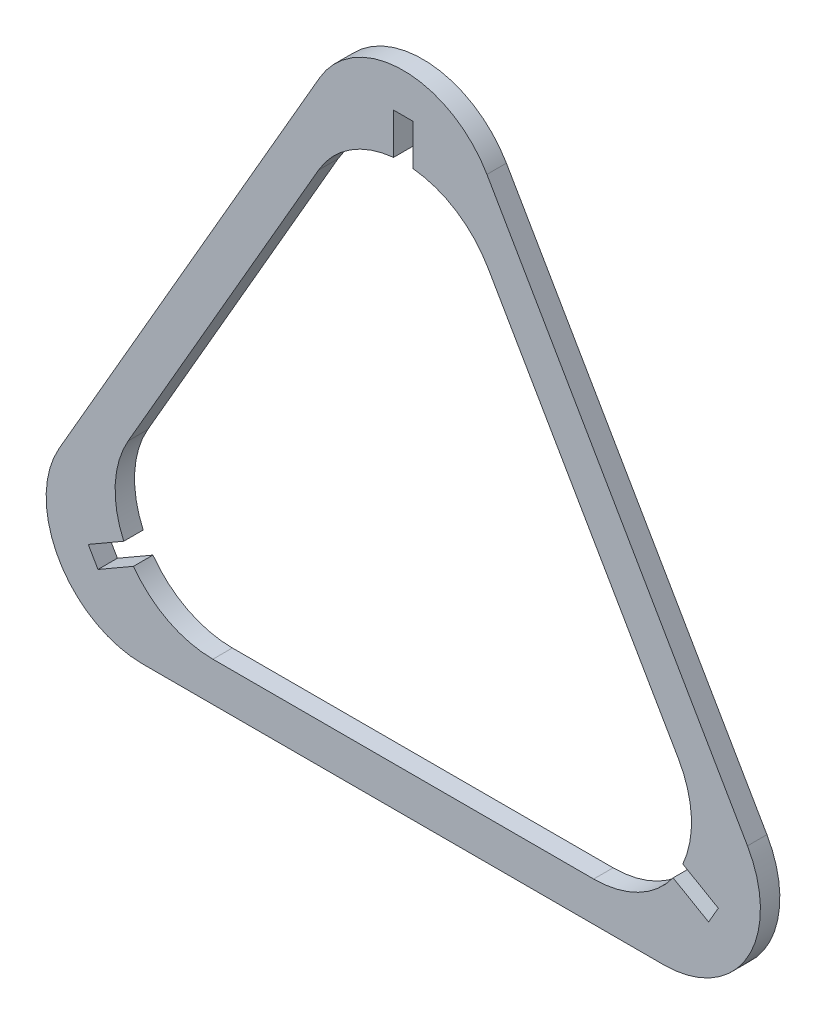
ISO-10303-21;
HEADER;
FILE_DESCRIPTION(('STEP AP214'),'2;1');
FILE_NAME('part.step','',(''),(''),'','','');
FILE_SCHEMA(('AUTOMOTIVE_DESIGN { 1 0 10303 214 1 1 1 1 }'));
ENDSEC;
DATA;
#1=APPLICATION_CONTEXT('core data for automotive mechanical design processes');
#2=APPLICATION_PROTOCOL_DEFINITION('international standard','automotive_design',2000,#1);
#3=PRODUCT_CONTEXT('',#1,'mechanical');
#4=PRODUCT('Part','Part','',(#3));
#5=PRODUCT_RELATED_PRODUCT_CATEGORY('part','',(#4));
#6=PRODUCT_DEFINITION_FORMATION('','',#4);
#7=PRODUCT_DEFINITION_CONTEXT('part definition',#1,'design');
#8=PRODUCT_DEFINITION('design','',#6,#7);
#9=PRODUCT_DEFINITION_SHAPE('','',#8);
#10=(LENGTH_UNIT() NAMED_UNIT(*) SI_UNIT(.MILLI.,.METRE.));
#11=(NAMED_UNIT(*) PLANE_ANGLE_UNIT() SI_UNIT($,.RADIAN.));
#12=(NAMED_UNIT(*) SI_UNIT($,.STERADIAN.) SOLID_ANGLE_UNIT());
#13=UNCERTAINTY_MEASURE_WITH_UNIT(LENGTH_MEASURE(1.E-05),#10,'distance_accuracy_value','');
#14=(GEOMETRIC_REPRESENTATION_CONTEXT(3) GLOBAL_UNCERTAINTY_ASSIGNED_CONTEXT((#13)) GLOBAL_UNIT_ASSIGNED_CONTEXT((#10,
#11,#12)) REPRESENTATION_CONTEXT('',''));
#15=CARTESIAN_POINT('',(0.,0.,0.));
#16=DIRECTION('',(0.,0.,1.));
#17=DIRECTION('',(1.,0.,0.));
#18=AXIS2_PLACEMENT_3D('',#15,#16,#17);
#19=CARTESIAN_POINT('',(39.1709623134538,-22.6153656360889,0.));
#20=DIRECTION('',(0.,0.,1.));
#21=DIRECTION('',(1.,0.,0.));
#22=AXIS2_PLACEMENT_3D('',#19,#20,#21);
#23=CYLINDRICAL_SURFACE('',#22,20.125);
#24=DIRECTION('',(0.,0.,1.));
#25=VECTOR('',#24,1.);
#26=CARTESIAN_POINT('',(57.513445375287,-30.8960020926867,0.));
#27=LINE('',#26,#25);
#28=CARTESIAN_POINT('',(57.513445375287,-30.8960020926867,0.));
#29=VERTEX_POINT('',#28);
#30=CARTESIAN_POINT('',(57.513445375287,-30.8960020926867,4.));
#31=VERTEX_POINT('',#30);
#32=EDGE_CURVE('E227',#29,#31,#27,.T.);
#33=ORIENTED_EDGE('',*,*,#32,.T.);
#34=CARTESIAN_POINT('',(39.1709623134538,-22.6153656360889,4.));
#35=DIRECTION('',(0.,0.,1.));
#36=DIRECTION('',(1.,0.,0.));
#37=AXIS2_PLACEMENT_3D('',#34,#35,#36);
#38=CIRCLE('',#37,20.125);
#39=CARTESIAN_POINT('',(56.5997235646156,-12.5528656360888,4.));
#40=VERTEX_POINT('',#39);
#41=EDGE_CURVE('E259',#40,#31,#38,.F.);
#42=ORIENTED_EDGE('',*,*,#41,.F.);
#43=DIRECTION('',(0.,0.,1.));
#44=VECTOR('',#43,1.);
#45=CARTESIAN_POINT('',(56.5997235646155,-12.5528656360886,0.));
#46=LINE('',#45,#44);
#47=CARTESIAN_POINT('',(56.5997235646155,-12.5528656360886,0.));
#48=VERTEX_POINT('',#47);
#49=EDGE_CURVE('E278',#48,#40,#46,.T.);
#50=ORIENTED_EDGE('',*,*,#49,.F.);
#51=CARTESIAN_POINT('',(39.1709623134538,-22.6153656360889,0.));
#52=DIRECTION('',(0.,0.,-1.));
#53=DIRECTION('',(-1.,0.,0.));
#54=AXIS2_PLACEMENT_3D('',#51,#52,#53);
#55=CIRCLE('',#54,20.125);
#56=EDGE_CURVE('E342',#48,#29,#55,.T.);
#57=ORIENTED_EDGE('',*,*,#56,.T.);
#58=EDGE_LOOP('',(#33,#42,#50,#57));
#59=FACE_BOUND('',#58,.T.);
#60=ADVANCED_FACE('F37',(#59),#23,.F.);
#61=CARTESIAN_POINT('',(-39.1709623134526,-22.6153656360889,0.));
#62=DIRECTION('',(0.,0.,1.));
#63=DIRECTION('',(1.,0.,0.));
#64=AXIS2_PLACEMENT_3D('',#61,#62,#63);
#65=CYLINDRICAL_SURFACE('',#64,20.125);
#66=CARTESIAN_POINT('',(-39.1709623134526,-22.6153656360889,0.));
#67=DIRECTION('',(0.,0.,-1.));
#68=DIRECTION('',(-1.,0.,0.));
#69=AXIS2_PLACEMENT_3D('',#66,#67,#68);
#70=CIRCLE('',#69,20.125);
#71=CARTESIAN_POINT('',(-55.5134453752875,-34.3601037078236,0.));
#72=VERTEX_POINT('',#71);
#73=CARTESIAN_POINT('',(-39.1709623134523,-42.7403656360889,0.));
#74=VERTEX_POINT('',#73);
#75=EDGE_CURVE('E357',#72,#74,#70,.F.);
#76=ORIENTED_EDGE('',*,*,#75,.F.);
#77=DIRECTION('',(0.,0.,1.));
#78=VECTOR('',#77,1.);
#79=CARTESIAN_POINT('',(-55.5134453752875,-34.3601037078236,0.));
#80=LINE('',#79,#78);
#81=CARTESIAN_POINT('',(-55.5134453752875,-34.3601037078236,4.));
#82=VERTEX_POINT('',#81);
#83=EDGE_CURVE('E253',#72,#82,#80,.T.);
#84=ORIENTED_EDGE('',*,*,#83,.T.);
#85=CARTESIAN_POINT('',(-39.1709623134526,-22.6153656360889,4.));
#86=DIRECTION('',(0.,0.,1.));
#87=DIRECTION('',(1.,0.,0.));
#88=AXIS2_PLACEMENT_3D('',#85,#86,#87);
#89=CIRCLE('',#88,20.125);
#90=CARTESIAN_POINT('',(-39.1709623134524,-42.7403656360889,4.));
#91=VERTEX_POINT('',#90);
#92=EDGE_CURVE('E272',#82,#91,#89,.T.);
#93=ORIENTED_EDGE('',*,*,#92,.T.);
#94=DIRECTION('',(0.,0.,1.));
#95=VECTOR('',#94,1.);
#96=CARTESIAN_POINT('',(-39.1709623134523,-42.7403656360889,0.));
#97=LINE('',#96,#95);
#98=EDGE_CURVE('E266',#74,#91,#97,.T.);
#99=ORIENTED_EDGE('',*,*,#98,.F.);
#100=EDGE_LOOP('',(#76,#84,#93,#99));
#101=FACE_BOUND('',#100,.T.);
#102=ADVANCED_FACE('F432',(#101),#65,.F.);
#103=CARTESIAN_POINT('',(6.20597323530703E-13,45.2307312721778,0.));
#104=DIRECTION('',(0.,0.,1.));
#105=DIRECTION('',(1.,0.,0.));
#106=AXIS2_PLACEMENT_3D('',#103,#104,#105);
#107=CYLINDRICAL_SURFACE('',#106,20.125);
#108=CARTESIAN_POINT('',(6.20597323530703E-13,45.2307312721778,4.));
#109=DIRECTION('',(0.,0.,1.));
#110=DIRECTION('',(1.,0.,0.));
#111=AXIS2_PLACEMENT_3D('',#108,#109,#110);
#112=CIRCLE('',#111,20.125);
#113=CARTESIAN_POINT('',(17.4287612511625,55.2932312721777,4.));
#114=VERTEX_POINT('',#113);
#115=CARTESIAN_POINT('',(2.,65.2561058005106,4.));
#116=VERTEX_POINT('',#115);
#117=EDGE_CURVE('E233',#114,#116,#112,.T.);
#118=ORIENTED_EDGE('',*,*,#117,.T.);
#119=DIRECTION('',(0.,0.,1.));
#120=VECTOR('',#119,1.);
#121=CARTESIAN_POINT('',(2.,65.2561058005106,0.));
#122=LINE('',#121,#120);
#123=CARTESIAN_POINT('',(2.,65.2561058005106,0.));
#124=VERTEX_POINT('',#123);
#125=EDGE_CURVE('E348',#116,#124,#122,.F.);
#126=ORIENTED_EDGE('',*,*,#125,.T.);
#127=CARTESIAN_POINT('',(6.20597323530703E-13,45.2307312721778,0.));
#128=DIRECTION('',(0.,0.,-1.));
#129=DIRECTION('',(-1.,0.,0.));
#130=AXIS2_PLACEMENT_3D('',#127,#128,#129);
#131=CIRCLE('',#130,20.125);
#132=CARTESIAN_POINT('',(17.4287612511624,55.2932312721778,0.));
#133=VERTEX_POINT('',#132);
#134=EDGE_CURVE('E41',#133,#124,#131,.F.);
#135=ORIENTED_EDGE('',*,*,#134,.F.);
#136=DIRECTION('',(0.,0.,1.));
#137=VECTOR('',#136,1.);
#138=CARTESIAN_POINT('',(17.4287612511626,55.2932312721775,0.));
#139=LINE('',#138,#137);
#140=EDGE_CURVE('E335',#133,#114,#139,.T.);
#141=ORIENTED_EDGE('',*,*,#140,.T.);
#142=EDGE_LOOP('',(#118,#126,#135,#141));
#143=FACE_BOUND('',#142,.T.);
#144=ADVANCED_FACE('F406',(#143),#107,.F.);
#145=CARTESIAN_POINT('',(0.,0.,0.));
#146=DIRECTION('',(0.,0.,1.));
#147=DIRECTION('',(1.,0.,0.));
#148=AXIS2_PLACEMENT_3D('',#145,#146,#147);
#149=PLANE('',#148);
#150=DIRECTION('',(-0.5,0.866025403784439,0.));
#151=VECTOR('',#150,1.);
#152=CARTESIAN_POINT('',(70.8169739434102,-21.0111989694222,0.));
#153=LINE('',#152,#151);
#154=CARTESIAN_POINT('',(70.8169739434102,-21.0111989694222,0.));
#155=VERTEX_POINT('',#154);
#156=CARTESIAN_POINT('',(17.2122549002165,71.8348979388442,0.));
#157=VERTEX_POINT('',#156);
#158=EDGE_CURVE('E316',#155,#157,#153,.T.);
#159=ORIENTED_EDGE('',*,*,#158,.F.);
#160=CARTESIAN_POINT('',(53.6047190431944,-30.9486989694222,0.));
#161=DIRECTION('',(0.,0.,-1.));
#162=DIRECTION('',(-1.,0.,0.));
#163=AXIS2_PLACEMENT_3D('',#160,#161,#162);
#164=CIRCLE('',#163,19.875);
#165=CARTESIAN_POINT('',(53.6047190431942,-50.8236989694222,0.));
#166=VERTEX_POINT('',#165);
#167=EDGE_CURVE('E331',#155,#166,#164,.T.);
#168=ORIENTED_EDGE('',*,*,#167,.T.);
#169=DIRECTION('',(1.,0.,0.));
#170=VECTOR('',#169,1.);
#171=CARTESIAN_POINT('',(53.6047190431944,-50.8236989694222,0.));
#172=LINE('',#171,#170);
#173=CARTESIAN_POINT('',(-53.6047190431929,-50.8236989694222,0.));
#174=VERTEX_POINT('',#173);
#175=EDGE_CURVE('E301',#174,#166,#172,.T.);
#176=ORIENTED_EDGE('',*,*,#175,.F.);
#177=CARTESIAN_POINT('',(-53.6047190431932,-30.9486989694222,0.));
#178=DIRECTION('',(0.,0.,-1.));
#179=DIRECTION('',(-1.,0.,0.));
#180=AXIS2_PLACEMENT_3D('',#177,#178,#179);
#181=CIRCLE('',#180,19.875);
#182=CARTESIAN_POINT('',(-70.8169739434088,-21.0111989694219,0.));
#183=VERTEX_POINT('',#182);
#184=EDGE_CURVE('E305',#183,#174,#181,.F.);
#185=ORIENTED_EDGE('',*,*,#184,.F.);
#186=DIRECTION('',(-0.5,-0.866025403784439,0.));
#187=VECTOR('',#186,1.);
#188=CARTESIAN_POINT('',(-44.014614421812,25.4118494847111,0.));
#189=LINE('',#188,#187);
#190=CARTESIAN_POINT('',(-17.2122549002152,71.8348979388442,0.));
#191=VERTEX_POINT('',#190);
#192=EDGE_CURVE('E309',#191,#183,#189,.T.);
#193=ORIENTED_EDGE('',*,*,#192,.F.);
#194=CARTESIAN_POINT('',(6.24500451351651E-13,61.8973979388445,0.));
#195=DIRECTION('',(0.,0.,-1.));
#196=DIRECTION('',(-1.,0.,0.));
#197=AXIS2_PLACEMENT_3D('',#194,#195,#196);
#198=CIRCLE('',#197,19.875);
#199=EDGE_CURVE('E313',#157,#191,#198,.F.);
#200=ORIENTED_EDGE('',*,*,#199,.F.);
#201=EDGE_LOOP('',(#159,#168,#176,#185,#193,#200));
#202=FACE_BOUND('',#201,.T.);
#203=DIRECTION('',(0.500000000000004,0.866025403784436,0.));
#204=VECTOR('',#203,1.);
#205=CARTESIAN_POINT('',(63.8166019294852,-36.8445323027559,0.));
#206=LINE('',#205,#204);
#207=CARTESIAN_POINT('',(62.8166019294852,-38.5765831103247,0.));
#208=VERTEX_POINT('',#207);
#209=CARTESIAN_POINT('',(64.8166019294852,-35.112481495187,0.));
#210=VERTEX_POINT('',#209);
#211=EDGE_CURVE('E211',#208,#210,#206,.T.);
#212=ORIENTED_EDGE('',*,*,#211,.T.);
#213=DIRECTION('',(-0.866025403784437,0.500000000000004,0.));
#214=VECTOR('',#213,1.);
#215=CARTESIAN_POINT('',(1.,1.73205080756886,0.));
#216=LINE('',#215,#214);
#217=EDGE_CURVE('E230',#210,#29,#216,.T.);
#218=ORIENTED_EDGE('',*,*,#217,.T.);
#219=ORIENTED_EDGE('',*,*,#56,.F.);
#220=DIRECTION('',(-0.5,0.866025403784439,0.));
#221=VECTOR('',#220,1.);
#222=CARTESIAN_POINT('',(56.5997235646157,-12.5528656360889,0.));
#223=LINE('',#222,#221);
#224=EDGE_CURVE('E350',#48,#133,#223,.T.);
#225=ORIENTED_EDGE('',*,*,#224,.T.);
#226=ORIENTED_EDGE('',*,*,#134,.T.);
#227=DIRECTION('',(0.,1.,0.));
#228=VECTOR('',#227,1.);
#229=CARTESIAN_POINT('',(2.00000000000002,0.,0.));
#230=LINE('',#229,#228);
#231=CARTESIAN_POINT('',(2.,73.6890646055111,0.));
#232=VERTEX_POINT('',#231);
#233=EDGE_CURVE('E322',#124,#232,#230,.T.);
#234=ORIENTED_EDGE('',*,*,#233,.T.);
#235=DIRECTION('',(-1.,0.,0.));
#236=VECTOR('',#235,1.);
#237=CARTESIAN_POINT('',(0.,73.6890646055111,0.));
#238=LINE('',#237,#236);
#239=CARTESIAN_POINT('',(-2.,73.6890646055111,0.));
#240=VERTEX_POINT('',#239);
#241=EDGE_CURVE('E334',#232,#240,#238,.T.);
#242=ORIENTED_EDGE('',*,*,#241,.T.);
#243=DIRECTION('',(0.,-1.,0.));
#244=VECTOR('',#243,1.);
#245=CARTESIAN_POINT('',(-1.99999999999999,0.,0.));
#246=LINE('',#245,#244);
#247=CARTESIAN_POINT('',(-2.,65.2561058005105,0.));
#248=VERTEX_POINT('',#247);
#249=EDGE_CURVE('E366',#240,#248,#246,.T.);
#250=ORIENTED_EDGE('',*,*,#249,.T.);
#251=CARTESIAN_POINT('',(-17.4287612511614,55.2932312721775,0.));
#252=VERTEX_POINT('',#251);
#253=EDGE_CURVE('E358',#248,#252,#131,.F.);
#254=ORIENTED_EDGE('',*,*,#253,.T.);
#255=DIRECTION('',(-0.5,-0.866025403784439,0.));
#256=VECTOR('',#255,1.);
#257=CARTESIAN_POINT('',(-37.0142424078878,21.3701828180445,0.));
#258=LINE('',#257,#256);
#259=CARTESIAN_POINT('',(-56.5997235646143,-12.5528656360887,0.));
#260=VERTEX_POINT('',#259);
#261=EDGE_CURVE('E354',#252,#260,#258,.T.);
#262=ORIENTED_EDGE('',*,*,#261,.T.);
#263=CARTESIAN_POINT('',(-57.5134453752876,-30.8960020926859,0.));
#264=VERTEX_POINT('',#263);
#265=EDGE_CURVE('E359',#260,#264,#70,.F.);
#266=ORIENTED_EDGE('',*,*,#265,.T.);
#267=DIRECTION('',(-0.866025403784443,-0.499999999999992,0.));
#268=VECTOR('',#267,1.);
#269=CARTESIAN_POINT('',(-0.999999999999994,1.7320508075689,0.));
#270=LINE('',#269,#268);
#271=CARTESIAN_POINT('',(-64.8166019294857,-35.1124814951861,0.));
#272=VERTEX_POINT('',#271);
#273=EDGE_CURVE('E240',#264,#272,#270,.T.);
#274=ORIENTED_EDGE('',*,*,#273,.T.);
#275=DIRECTION('',(0.499999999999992,-0.866025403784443,0.));
#276=VECTOR('',#275,1.);
#277=CARTESIAN_POINT('',(-63.8166019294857,-36.844532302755,0.));
#278=LINE('',#277,#276);
#279=CARTESIAN_POINT('',(-62.8166019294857,-38.5765831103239,0.));
#280=VERTEX_POINT('',#279);
#281=EDGE_CURVE('E248',#272,#280,#278,.T.);
#282=ORIENTED_EDGE('',*,*,#281,.T.);
#283=DIRECTION('',(0.866025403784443,0.499999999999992,0.));
#284=VECTOR('',#283,1.);
#285=CARTESIAN_POINT('',(0.999999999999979,-1.73205080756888,0.));
#286=LINE('',#285,#284);
#287=EDGE_CURVE('E256',#280,#72,#286,.T.);
#288=ORIENTED_EDGE('',*,*,#287,.T.);
#289=ORIENTED_EDGE('',*,*,#75,.T.);
#290=DIRECTION('',(1.,0.,0.));
#291=VECTOR('',#290,1.);
#292=CARTESIAN_POINT('',(39.1709623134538,-42.7403656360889,0.));
#293=LINE('',#292,#291);
#294=CARTESIAN_POINT('',(39.1709623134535,-42.7403656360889,0.));
#295=VERTEX_POINT('',#294);
#296=EDGE_CURVE('E353',#74,#295,#293,.T.);
#297=ORIENTED_EDGE('',*,*,#296,.T.);
#298=CARTESIAN_POINT('',(55.5134453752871,-34.3601037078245,0.));
#299=VERTEX_POINT('',#298);
#300=EDGE_CURVE('E319',#299,#295,#55,.T.);
#301=ORIENTED_EDGE('',*,*,#300,.F.);
#302=DIRECTION('',(0.866025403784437,-0.500000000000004,0.));
#303=VECTOR('',#302,1.);
#304=CARTESIAN_POINT('',(-1.00000000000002,-1.73205080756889,0.));
#305=LINE('',#304,#303);
#306=EDGE_CURVE('E213',#299,#208,#305,.T.);
#307=ORIENTED_EDGE('',*,*,#306,.T.);
#308=EDGE_LOOP('',(#212,#218,#219,#225,#226,#234,#242,#250,#254,#262,#266,#274,#282,#288,#289,
#297,#301,#307));
#309=FACE_BOUND('',#308,.T.);
#310=ADVANCED_FACE('F39',(#202,#309),#149,.F.);
#311=CARTESIAN_POINT('',(70.8169739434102,-21.0111989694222,0.));
#312=DIRECTION('',(0.866025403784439,0.5,0.));
#313=DIRECTION('',(-0.5,0.866025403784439,0.));
#314=AXIS2_PLACEMENT_3D('',#311,#312,#313);
#315=PLANE('',#314);
#316=DIRECTION('',(0.,0.,1.));
#317=VECTOR('',#316,1.);
#318=CARTESIAN_POINT('',(70.81697394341,-21.011198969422,0.));
#319=LINE('',#318,#317);
#320=CARTESIAN_POINT('',(70.8169739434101,-21.0111989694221,4.));
#321=VERTEX_POINT('',#320);
#322=EDGE_CURVE('E282',#155,#321,#319,.T.);
#323=ORIENTED_EDGE('',*,*,#322,.F.);
#324=ORIENTED_EDGE('',*,*,#158,.T.);
#325=DIRECTION('',(0.,0.,1.));
#326=VECTOR('',#325,1.);
#327=CARTESIAN_POINT('',(17.2122549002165,71.8348979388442,0.));
#328=LINE('',#327,#326);
#329=CARTESIAN_POINT('',(17.2122549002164,71.8348979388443,4.));
#330=VERTEX_POINT('',#329);
#331=EDGE_CURVE('E314',#157,#330,#328,.T.);
#332=ORIENTED_EDGE('',*,*,#331,.T.);
#333=DIRECTION('',(-0.5,0.866025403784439,0.));
#334=VECTOR('',#333,1.);
#335=CARTESIAN_POINT('',(70.8169739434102,-21.0111989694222,4.));
#336=LINE('',#335,#334);
#337=EDGE_CURVE('E261',#321,#330,#336,.T.);
#338=ORIENTED_EDGE('',*,*,#337,.F.);
#339=EDGE_LOOP('',(#323,#324,#332,#338));
#340=FACE_BOUND('',#339,.T.);
#341=ADVANCED_FACE('F498',(#340),#315,.T.);
#342=CARTESIAN_POINT('',(6.24500451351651E-13,61.8973979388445,0.));
#343=DIRECTION('',(0.,0.,1.));
#344=DIRECTION('',(1.,0.,0.));
#345=AXIS2_PLACEMENT_3D('',#342,#343,#344);
#346=CYLINDRICAL_SURFACE('',#345,19.875);
#347=ORIENTED_EDGE('',*,*,#331,.F.);
#348=ORIENTED_EDGE('',*,*,#199,.T.);
#349=DIRECTION('',(0.,0.,1.));
#350=VECTOR('',#349,1.);
#351=CARTESIAN_POINT('',(-17.2122549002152,71.8348979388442,0.));
#352=LINE('',#351,#350);
#353=CARTESIAN_POINT('',(-17.2122549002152,71.8348979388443,4.));
#354=VERTEX_POINT('',#353);
#355=EDGE_CURVE('E310',#191,#354,#352,.T.);
#356=ORIENTED_EDGE('',*,*,#355,.T.);
#357=CARTESIAN_POINT('',(6.24500451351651E-13,61.8973979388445,4.));
#358=DIRECTION('',(0.,0.,1.));
#359=DIRECTION('',(1.,0.,0.));
#360=AXIS2_PLACEMENT_3D('',#357,#358,#359);
#361=CIRCLE('',#360,19.875);
#362=EDGE_CURVE('E294',#330,#354,#361,.T.);
#363=ORIENTED_EDGE('',*,*,#362,.F.);
#364=EDGE_LOOP('',(#347,#348,#356,#363));
#365=FACE_BOUND('',#364,.T.);
#366=ADVANCED_FACE('F495',(#365),#346,.T.);
#367=CARTESIAN_POINT('',(-44.014614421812,25.4118494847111,0.));
#368=DIRECTION('',(-0.866025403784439,0.5,0.));
#369=DIRECTION('',(-0.5,-0.866025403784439,0.));
#370=AXIS2_PLACEMENT_3D('',#367,#368,#369);
#371=PLANE('',#370);
#372=ORIENTED_EDGE('',*,*,#355,.F.);
#373=ORIENTED_EDGE('',*,*,#192,.T.);
#374=DIRECTION('',(0.,0.,1.));
#375=VECTOR('',#374,1.);
#376=CARTESIAN_POINT('',(-70.8169739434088,-21.0111989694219,0.));
#377=LINE('',#376,#375);
#378=CARTESIAN_POINT('',(-70.8169739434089,-21.0111989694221,4.));
#379=VERTEX_POINT('',#378);
#380=EDGE_CURVE('E306',#183,#379,#377,.T.);
#381=ORIENTED_EDGE('',*,*,#380,.T.);
#382=DIRECTION('',(-0.5,-0.866025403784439,0.));
#383=VECTOR('',#382,1.);
#384=CARTESIAN_POINT('',(-17.2122549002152,71.8348979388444,4.));
#385=LINE('',#384,#383);
#386=EDGE_CURVE('E291',#354,#379,#385,.T.);
#387=ORIENTED_EDGE('',*,*,#386,.F.);
#388=EDGE_LOOP('',(#372,#373,#381,#387));
#389=FACE_BOUND('',#388,.T.);
#390=ADVANCED_FACE('F491',(#389),#371,.T.);
#391=CARTESIAN_POINT('',(-53.6047190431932,-30.9486989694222,0.));
#392=DIRECTION('',(0.,0.,1.));
#393=DIRECTION('',(1.,0.,0.));
#394=AXIS2_PLACEMENT_3D('',#391,#392,#393);
#395=CYLINDRICAL_SURFACE('',#394,19.875);
#396=ORIENTED_EDGE('',*,*,#380,.F.);
#397=ORIENTED_EDGE('',*,*,#184,.T.);
#398=DIRECTION('',(0.,0.,1.));
#399=VECTOR('',#398,1.);
#400=CARTESIAN_POINT('',(-53.6047190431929,-50.8236989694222,0.));
#401=LINE('',#400,#399);
#402=CARTESIAN_POINT('',(-53.6047190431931,-50.8236989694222,4.));
#403=VERTEX_POINT('',#402);
#404=EDGE_CURVE('E302',#174,#403,#401,.T.);
#405=ORIENTED_EDGE('',*,*,#404,.T.);
#406=CARTESIAN_POINT('',(-53.6047190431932,-30.9486989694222,4.));
#407=DIRECTION('',(0.,0.,1.));
#408=DIRECTION('',(1.,0.,0.));
#409=AXIS2_PLACEMENT_3D('',#406,#407,#408);
#410=CIRCLE('',#409,19.875);
#411=EDGE_CURVE('E288',#379,#403,#410,.T.);
#412=ORIENTED_EDGE('',*,*,#411,.F.);
#413=EDGE_LOOP('',(#396,#397,#405,#412));
#414=FACE_BOUND('',#413,.T.);
#415=ADVANCED_FACE('F487',(#414),#395,.T.);
#416=CARTESIAN_POINT('',(53.6047190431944,-50.8236989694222,0.));
#417=DIRECTION('',(0.,-1.,0.));
#418=DIRECTION('',(0.,0.,-1.));
#419=AXIS2_PLACEMENT_3D('',#416,#417,#418);
#420=PLANE('',#419);
#421=ORIENTED_EDGE('',*,*,#404,.F.);
#422=ORIENTED_EDGE('',*,*,#175,.T.);
#423=DIRECTION('',(0.,0.,1.));
#424=VECTOR('',#423,1.);
#425=CARTESIAN_POINT('',(53.6047190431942,-50.8236989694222,0.));
#426=LINE('',#425,#424);
#427=CARTESIAN_POINT('',(53.6047190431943,-50.8236989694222,4.));
#428=VERTEX_POINT('',#427);
#429=EDGE_CURVE('E283',#166,#428,#426,.T.);
#430=ORIENTED_EDGE('',*,*,#429,.T.);
#431=DIRECTION('',(1.,0.,0.));
#432=VECTOR('',#431,1.);
#433=CARTESIAN_POINT('',(0.,-50.8236989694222,4.));
#434=LINE('',#433,#432);
#435=EDGE_CURVE('E284',#403,#428,#434,.T.);
#436=ORIENTED_EDGE('',*,*,#435,.F.);
#437=EDGE_LOOP('',(#421,#422,#430,#436));
#438=FACE_BOUND('',#437,.T.);
#439=ADVANCED_FACE('F452',(#438),#420,.T.);
#440=CARTESIAN_POINT('',(53.6047190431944,-30.9486989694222,0.));
#441=DIRECTION('',(0.,0.,1.));
#442=DIRECTION('',(1.,0.,0.));
#443=AXIS2_PLACEMENT_3D('',#440,#441,#442);
#444=CYLINDRICAL_SURFACE('',#443,19.875);
#445=CARTESIAN_POINT('',(53.6047190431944,-30.9486989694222,4.));
#446=DIRECTION('',(0.,0.,1.));
#447=DIRECTION('',(1.,0.,0.));
#448=AXIS2_PLACEMENT_3D('',#445,#446,#447);
#449=CIRCLE('',#448,19.875);
#450=EDGE_CURVE('E280',#321,#428,#449,.F.);
#451=ORIENTED_EDGE('',*,*,#450,.T.);
#452=ORIENTED_EDGE('',*,*,#429,.F.);
#453=ORIENTED_EDGE('',*,*,#167,.F.);
#454=ORIENTED_EDGE('',*,*,#322,.T.);
#455=EDGE_LOOP('',(#451,#452,#453,#454));
#456=FACE_BOUND('',#455,.T.);
#457=ADVANCED_FACE('F445',(#456),#444,.T.);
#458=DIRECTION('',(0.,0.,1.));
#459=VECTOR('',#458,1.);
#460=CARTESIAN_POINT('',(55.5134453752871,-34.3601037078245,0.));
#461=LINE('',#460,#459);
#462=CARTESIAN_POINT('',(55.5134453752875,-34.3601037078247,4.));
#463=VERTEX_POINT('',#462);
#464=EDGE_CURVE('E62',#463,#299,#461,.F.);
#465=ORIENTED_EDGE('',*,*,#464,.T.);
#466=ORIENTED_EDGE('',*,*,#300,.T.);
#467=DIRECTION('',(0.,0.,1.));
#468=VECTOR('',#467,1.);
#469=CARTESIAN_POINT('',(39.1709623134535,-42.7403656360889,0.));
#470=LINE('',#469,#468);
#471=CARTESIAN_POINT('',(39.1709623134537,-42.7403656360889,4.));
#472=VERTEX_POINT('',#471);
#473=EDGE_CURVE('E267',#295,#472,#470,.T.);
#474=ORIENTED_EDGE('',*,*,#473,.T.);
#475=EDGE_CURVE('E262',#463,#472,#38,.F.);
#476=ORIENTED_EDGE('',*,*,#475,.F.);
#477=EDGE_LOOP('',(#465,#466,#474,#476));
#478=FACE_BOUND('',#477,.T.);
#479=ADVANCED_FACE('F435',(#478),#23,.F.);
#480=CARTESIAN_POINT('',(39.1709623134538,-42.7403656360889,0.));
#481=DIRECTION('',(0.,-1.,0.));
#482=DIRECTION('',(1.,0.,0.));
#483=AXIS2_PLACEMENT_3D('',#480,#481,#482);
#484=PLANE('',#483);
#485=DIRECTION('',(1.,0.,0.));
#486=VECTOR('',#485,1.);
#487=CARTESIAN_POINT('',(39.1709623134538,-42.7403656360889,4.));
#488=LINE('',#487,#486);
#489=EDGE_CURVE('E263',#91,#472,#488,.T.);
#490=ORIENTED_EDGE('',*,*,#489,.T.);
#491=ORIENTED_EDGE('',*,*,#473,.F.);
#492=ORIENTED_EDGE('',*,*,#296,.F.);
#493=ORIENTED_EDGE('',*,*,#98,.T.);
#494=EDGE_LOOP('',(#490,#491,#492,#493));
#495=FACE_BOUND('',#494,.T.);
#496=ADVANCED_FACE('F444',(#495),#484,.F.);
#497=CARTESIAN_POINT('',(-56.5997235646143,-12.5528656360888,4.));
#498=VERTEX_POINT('',#497);
#499=CARTESIAN_POINT('',(-57.513445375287,-30.8960020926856,4.));
#500=VERTEX_POINT('',#499);
#501=EDGE_CURVE('E268',#498,#500,#89,.T.);
#502=ORIENTED_EDGE('',*,*,#501,.T.);
#503=DIRECTION('',(0.,0.,1.));
#504=VECTOR('',#503,1.);
#505=CARTESIAN_POINT('',(-57.5134453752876,-30.8960020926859,0.));
#506=LINE('',#505,#504);
#507=EDGE_CURVE('E54',#500,#264,#506,.F.);
#508=ORIENTED_EDGE('',*,*,#507,.T.);
#509=ORIENTED_EDGE('',*,*,#265,.F.);
#510=DIRECTION('',(0.,0.,1.));
#511=VECTOR('',#510,1.);
#512=CARTESIAN_POINT('',(-56.5997235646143,-12.5528656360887,0.));
#513=LINE('',#512,#511);
#514=EDGE_CURVE('E271',#260,#498,#513,.T.);
#515=ORIENTED_EDGE('',*,*,#514,.T.);
#516=EDGE_LOOP('',(#502,#508,#509,#515));
#517=FACE_BOUND('',#516,.T.);
#518=ADVANCED_FACE('F399',(#517),#65,.F.);
#519=CARTESIAN_POINT('',(-37.0142424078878,21.3701828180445,0.));
#520=DIRECTION('',(-0.866025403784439,0.5,0.));
#521=DIRECTION('',(-0.5,-0.866025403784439,0.));
#522=AXIS2_PLACEMENT_3D('',#519,#520,#521);
#523=PLANE('',#522);
#524=DIRECTION('',(-0.5,-0.866025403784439,0.));
#525=VECTOR('',#524,1.);
#526=CARTESIAN_POINT('',(-37.0142424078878,21.3701828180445,4.));
#527=LINE('',#526,#525);
#528=CARTESIAN_POINT('',(-17.4287612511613,55.2932312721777,4.));
#529=VERTEX_POINT('',#528);
#530=EDGE_CURVE('E273',#529,#498,#527,.T.);
#531=ORIENTED_EDGE('',*,*,#530,.T.);
#532=ORIENTED_EDGE('',*,*,#514,.F.);
#533=ORIENTED_EDGE('',*,*,#261,.F.);
#534=DIRECTION('',(0.,0.,1.));
#535=VECTOR('',#534,1.);
#536=CARTESIAN_POINT('',(-17.4287612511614,55.2932312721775,0.));
#537=LINE('',#536,#535);
#538=EDGE_CURVE('E275',#252,#529,#537,.T.);
#539=ORIENTED_EDGE('',*,*,#538,.T.);
#540=EDGE_LOOP('',(#531,#532,#533,#539));
#541=FACE_BOUND('',#540,.T.);
#542=ADVANCED_FACE('F395',(#541),#523,.F.);
#543=ORIENTED_EDGE('',*,*,#253,.F.);
#544=DIRECTION('',(0.,0.,1.));
#545=VECTOR('',#544,1.);
#546=CARTESIAN_POINT('',(-2.,65.2561058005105,0.));
#547=LINE('',#546,#545);
#548=CARTESIAN_POINT('',(-2.,65.2561058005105,4.));
#549=VERTEX_POINT('',#548);
#550=EDGE_CURVE('E345',#248,#549,#547,.T.);
#551=ORIENTED_EDGE('',*,*,#550,.T.);
#552=EDGE_CURVE('E279',#549,#529,#112,.T.);
#553=ORIENTED_EDGE('',*,*,#552,.T.);
#554=ORIENTED_EDGE('',*,*,#538,.F.);
#555=EDGE_LOOP('',(#543,#551,#553,#554));
#556=FACE_BOUND('',#555,.T.);
#557=ADVANCED_FACE('F390',(#556),#107,.F.);
#558=CARTESIAN_POINT('',(56.5997235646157,-12.5528656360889,0.));
#559=DIRECTION('',(0.866025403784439,0.5,0.));
#560=DIRECTION('',(-0.5,0.866025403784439,0.));
#561=AXIS2_PLACEMENT_3D('',#558,#559,#560);
#562=PLANE('',#561);
#563=DIRECTION('',(-0.5,0.866025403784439,0.));
#564=VECTOR('',#563,1.);
#565=CARTESIAN_POINT('',(56.5997235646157,-12.5528656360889,4.));
#566=LINE('',#565,#564);
#567=EDGE_CURVE('E276',#40,#114,#566,.T.);
#568=ORIENTED_EDGE('',*,*,#567,.T.);
#569=ORIENTED_EDGE('',*,*,#140,.F.);
#570=ORIENTED_EDGE('',*,*,#224,.F.);
#571=ORIENTED_EDGE('',*,*,#49,.T.);
#572=EDGE_LOOP('',(#568,#569,#570,#571));
#573=FACE_BOUND('',#572,.T.);
#574=ADVANCED_FACE('F408',(#573),#562,.F.);
#575=CARTESIAN_POINT('',(0.,0.,4.));
#576=DIRECTION('',(0.,0.,1.));
#577=DIRECTION('',(1.,0.,0.));
#578=AXIS2_PLACEMENT_3D('',#575,#576,#577);
#579=PLANE('',#578);
#580=DIRECTION('',(-0.866025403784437,0.500000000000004,0.));
#581=VECTOR('',#580,1.);
#582=CARTESIAN_POINT('',(64.7083487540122,-35.049981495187,4.));
#583=LINE('',#582,#581);
#584=CARTESIAN_POINT('',(64.8166019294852,-35.112481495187,4.));
#585=VERTEX_POINT('',#584);
#586=EDGE_CURVE('E219',#585,#31,#583,.T.);
#587=ORIENTED_EDGE('',*,*,#586,.F.);
#588=DIRECTION('',(-0.500000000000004,-0.866025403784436,0.));
#589=VECTOR('',#588,1.);
#590=CARTESIAN_POINT('',(64.7541019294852,-35.2207346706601,4.));
#591=LINE('',#590,#589);
#592=CARTESIAN_POINT('',(62.8166019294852,-38.5765831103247,4.));
#593=VERTEX_POINT('',#592);
#594=EDGE_CURVE('E208',#593,#585,#591,.F.);
#595=ORIENTED_EDGE('',*,*,#594,.F.);
#596=DIRECTION('',(0.866025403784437,-0.500000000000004,0.));
#597=VECTOR('',#596,1.);
#598=CARTESIAN_POINT('',(-1.00000000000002,-1.73205080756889,4.));
#599=LINE('',#598,#597);
#600=EDGE_CURVE('E197',#463,#593,#599,.T.);
#601=ORIENTED_EDGE('',*,*,#600,.F.);
#602=ORIENTED_EDGE('',*,*,#475,.T.);
#603=ORIENTED_EDGE('',*,*,#489,.F.);
#604=ORIENTED_EDGE('',*,*,#92,.F.);
#605=DIRECTION('',(0.866025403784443,0.499999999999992,0.));
#606=VECTOR('',#605,1.);
#607=CARTESIAN_POINT('',(-62.7083487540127,-38.5140831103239,4.));
#608=LINE('',#607,#606);
#609=CARTESIAN_POINT('',(-62.8166019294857,-38.5765831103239,4.));
#610=VERTEX_POINT('',#609);
#611=EDGE_CURVE('E251',#610,#82,#608,.T.);
#612=ORIENTED_EDGE('',*,*,#611,.F.);
#613=DIRECTION('',(-0.499999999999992,0.866025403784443,0.));
#614=VECTOR('',#613,1.);
#615=CARTESIAN_POINT('',(-62.8791019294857,-38.4683299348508,4.));
#616=LINE('',#615,#614);
#617=CARTESIAN_POINT('',(-64.8166019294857,-35.1124814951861,4.));
#618=VERTEX_POINT('',#617);
#619=EDGE_CURVE('E243',#618,#610,#616,.F.);
#620=ORIENTED_EDGE('',*,*,#619,.F.);
#621=DIRECTION('',(-0.866025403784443,-0.499999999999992,0.));
#622=VECTOR('',#621,1.);
#623=CARTESIAN_POINT('',(-0.999999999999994,1.7320508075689,4.));
#624=LINE('',#623,#622);
#625=EDGE_CURVE('E235',#500,#618,#624,.T.);
#626=ORIENTED_EDGE('',*,*,#625,.F.);
#627=ORIENTED_EDGE('',*,*,#501,.F.);
#628=ORIENTED_EDGE('',*,*,#530,.F.);
#629=ORIENTED_EDGE('',*,*,#552,.F.);
#630=DIRECTION('',(0.,-1.,0.));
#631=VECTOR('',#630,1.);
#632=CARTESIAN_POINT('',(-2.,73.5640646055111,4.));
#633=LINE('',#632,#631);
#634=CARTESIAN_POINT('',(-2.,73.6890646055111,4.));
#635=VERTEX_POINT('',#634);
#636=EDGE_CURVE('E379',#635,#549,#633,.T.);
#637=ORIENTED_EDGE('',*,*,#636,.F.);
#638=DIRECTION('',(1.,0.,0.));
#639=VECTOR('',#638,1.);
#640=CARTESIAN_POINT('',(-1.875,73.6890646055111,4.));
#641=LINE('',#640,#639);
#642=CARTESIAN_POINT('',(2.,73.6890646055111,4.));
#643=VERTEX_POINT('',#642);
#644=EDGE_CURVE('E46',#643,#635,#641,.F.);
#645=ORIENTED_EDGE('',*,*,#644,.F.);
#646=DIRECTION('',(0.,1.,0.));
#647=VECTOR('',#646,1.);
#648=CARTESIAN_POINT('',(2.00000000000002,0.,4.));
#649=LINE('',#648,#647);
#650=EDGE_CURVE('E11',#116,#643,#649,.T.);
#651=ORIENTED_EDGE('',*,*,#650,.F.);
#652=ORIENTED_EDGE('',*,*,#117,.F.);
#653=ORIENTED_EDGE('',*,*,#567,.F.);
#654=ORIENTED_EDGE('',*,*,#41,.T.);
#655=EDGE_LOOP('',(#587,#595,#601,#602,#603,#604,#612,#620,#626,#627,#628,#629,#637,#645,#651,
#652,#653,#654));
#656=FACE_BOUND('',#655,.T.);
#657=ORIENTED_EDGE('',*,*,#450,.F.);
#658=ORIENTED_EDGE('',*,*,#337,.T.);
#659=ORIENTED_EDGE('',*,*,#362,.T.);
#660=ORIENTED_EDGE('',*,*,#386,.T.);
#661=ORIENTED_EDGE('',*,*,#411,.T.);
#662=ORIENTED_EDGE('',*,*,#435,.T.);
#663=EDGE_LOOP('',(#657,#658,#659,#660,#661,#662));
#664=FACE_BOUND('',#663,.T.);
#665=ADVANCED_FACE('F216',(#656,#664),#579,.T.);
#666=CARTESIAN_POINT('',(-2.,73.5640646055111,-6.));
#667=DIRECTION('',(-1.,0.,0.));
#668=DIRECTION('',(0.,-1.,0.));
#669=AXIS2_PLACEMENT_3D('',#666,#667,#668);
#670=PLANE('',#669);
#671=DIRECTION('',(0.,0.,1.));
#672=VECTOR('',#671,1.);
#673=CARTESIAN_POINT('',(-2.,73.6890646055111,-6.));
#674=LINE('',#673,#672);
#675=EDGE_CURVE('E287',#240,#635,#674,.T.);
#676=ORIENTED_EDGE('',*,*,#675,.T.);
#677=ORIENTED_EDGE('',*,*,#636,.T.);
#678=ORIENTED_EDGE('',*,*,#550,.F.);
#679=ORIENTED_EDGE('',*,*,#249,.F.);
#680=EDGE_LOOP('',(#676,#677,#678,#679));
#681=FACE_BOUND('',#680,.T.);
#682=ADVANCED_FACE('F420',(#681),#670,.F.);
#683=CARTESIAN_POINT('',(-1.875,73.6890646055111,-6.));
#684=DIRECTION('',(0.,1.,0.));
#685=DIRECTION('',(0.,0.,1.));
#686=AXIS2_PLACEMENT_3D('',#683,#684,#685);
#687=PLANE('',#686);
#688=DIRECTION('',(0.,0.,1.));
#689=VECTOR('',#688,1.);
#690=CARTESIAN_POINT('',(2.,73.6890646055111,-6.));
#691=LINE('',#690,#689);
#692=EDGE_CURVE('E377',#232,#643,#691,.T.);
#693=ORIENTED_EDGE('',*,*,#692,.T.);
#694=ORIENTED_EDGE('',*,*,#644,.T.);
#695=ORIENTED_EDGE('',*,*,#675,.F.);
#696=ORIENTED_EDGE('',*,*,#241,.F.);
#697=EDGE_LOOP('',(#693,#694,#695,#696));
#698=FACE_BOUND('',#697,.T.);
#699=ADVANCED_FACE('F417',(#698),#687,.F.);
#700=CARTESIAN_POINT('',(2.,73.5640646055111,-6.));
#701=DIRECTION('',(1.,0.,0.));
#702=DIRECTION('',(0.,1.,0.));
#703=AXIS2_PLACEMENT_3D('',#700,#701,#702);
#704=PLANE('',#703);
#705=ORIENTED_EDGE('',*,*,#125,.F.);
#706=ORIENTED_EDGE('',*,*,#650,.T.);
#707=ORIENTED_EDGE('',*,*,#692,.F.);
#708=ORIENTED_EDGE('',*,*,#233,.F.);
#709=EDGE_LOOP('',(#705,#706,#707,#708));
#710=FACE_BOUND('',#709,.T.);
#711=ADVANCED_FACE('F415',(#710),#704,.F.);
#712=CARTESIAN_POINT('',(-62.7083487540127,-38.5140831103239,-6.));
#713=DIRECTION('',(0.499999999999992,-0.866025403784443,0.));
#714=DIRECTION('',(0.866025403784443,0.499999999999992,0.));
#715=AXIS2_PLACEMENT_3D('',#712,#713,#714);
#716=PLANE('',#715);
#717=DIRECTION('',(0.,0.,1.));
#718=VECTOR('',#717,1.);
#719=CARTESIAN_POINT('',(-62.8166019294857,-38.5765831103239,-6.));
#720=LINE('',#719,#718);
#721=EDGE_CURVE('E245',#280,#610,#720,.T.);
#722=ORIENTED_EDGE('',*,*,#721,.T.);
#723=ORIENTED_EDGE('',*,*,#611,.T.);
#724=ORIENTED_EDGE('',*,*,#83,.F.);
#725=ORIENTED_EDGE('',*,*,#287,.F.);
#726=EDGE_LOOP('',(#722,#723,#724,#725));
#727=FACE_BOUND('',#726,.T.);
#728=ADVANCED_FACE('F466',(#727),#716,.F.);
#729=CARTESIAN_POINT('',(-62.8791019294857,-38.4683299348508,-6.));
#730=DIRECTION('',(-0.866025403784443,-0.499999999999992,0.));
#731=DIRECTION('',(0.,0.,1.));
#732=AXIS2_PLACEMENT_3D('',#729,#730,#731);
#733=PLANE('',#732);
#734=DIRECTION('',(0.,0.,1.));
#735=VECTOR('',#734,1.);
#736=CARTESIAN_POINT('',(-64.8166019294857,-35.1124814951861,-6.));
#737=LINE('',#736,#735);
#738=EDGE_CURVE('E237',#272,#618,#737,.T.);
#739=ORIENTED_EDGE('',*,*,#738,.T.);
#740=ORIENTED_EDGE('',*,*,#619,.T.);
#741=ORIENTED_EDGE('',*,*,#721,.F.);
#742=ORIENTED_EDGE('',*,*,#281,.F.);
#743=EDGE_LOOP('',(#739,#740,#741,#742));
#744=FACE_BOUND('',#743,.T.);
#745=ADVANCED_FACE('F469',(#744),#733,.F.);
#746=CARTESIAN_POINT('',(-64.7083487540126,-35.0499814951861,-6.));
#747=DIRECTION('',(-0.499999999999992,0.866025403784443,0.));
#748=DIRECTION('',(-0.866025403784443,-0.499999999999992,0.));
#749=AXIS2_PLACEMENT_3D('',#746,#747,#748);
#750=PLANE('',#749);
#751=ORIENTED_EDGE('',*,*,#507,.F.);
#752=ORIENTED_EDGE('',*,*,#625,.T.);
#753=ORIENTED_EDGE('',*,*,#738,.F.);
#754=ORIENTED_EDGE('',*,*,#273,.F.);
#755=EDGE_LOOP('',(#751,#752,#753,#754));
#756=FACE_BOUND('',#755,.T.);
#757=ADVANCED_FACE('F470',(#756),#750,.F.);
#758=CARTESIAN_POINT('',(64.7083487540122,-35.049981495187,-6.));
#759=DIRECTION('',(0.500000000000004,0.866025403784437,0.));
#760=DIRECTION('',(-0.866025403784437,0.500000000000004,0.));
#761=AXIS2_PLACEMENT_3D('',#758,#759,#760);
#762=PLANE('',#761);
#763=DIRECTION('',(0.,0.,1.));
#764=VECTOR('',#763,1.);
#765=CARTESIAN_POINT('',(64.8166019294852,-35.112481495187,-6.));
#766=LINE('',#765,#764);
#767=EDGE_CURVE('E220',#210,#585,#766,.T.);
#768=ORIENTED_EDGE('',*,*,#767,.T.);
#769=ORIENTED_EDGE('',*,*,#586,.T.);
#770=ORIENTED_EDGE('',*,*,#32,.F.);
#771=ORIENTED_EDGE('',*,*,#217,.F.);
#772=EDGE_LOOP('',(#768,#769,#770,#771));
#773=FACE_BOUND('',#772,.T.);
#774=ADVANCED_FACE('F472',(#773),#762,.F.);
#775=CARTESIAN_POINT('',(64.7541019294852,-35.2207346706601,-6.));
#776=DIRECTION('',(0.866025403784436,-0.500000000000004,0.));
#777=DIRECTION('',(0.,0.,1.));
#778=AXIS2_PLACEMENT_3D('',#775,#776,#777);
#779=PLANE('',#778);
#780=DIRECTION('',(0.,0.,1.));
#781=VECTOR('',#780,1.);
#782=CARTESIAN_POINT('',(62.8166019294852,-38.5765831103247,-6.));
#783=LINE('',#782,#781);
#784=EDGE_CURVE('E200',#208,#593,#783,.T.);
#785=ORIENTED_EDGE('',*,*,#784,.T.);
#786=ORIENTED_EDGE('',*,*,#594,.T.);
#787=ORIENTED_EDGE('',*,*,#767,.F.);
#788=ORIENTED_EDGE('',*,*,#211,.F.);
#789=EDGE_LOOP('',(#785,#786,#787,#788));
#790=FACE_BOUND('',#789,.T.);
#791=ADVANCED_FACE('F207',(#790),#779,.F.);
#792=CARTESIAN_POINT('',(62.7083487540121,-38.5140831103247,-6.));
#793=DIRECTION('',(-0.500000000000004,-0.866025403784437,0.));
#794=DIRECTION('',(0.866025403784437,-0.500000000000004,0.));
#795=AXIS2_PLACEMENT_3D('',#792,#793,#794);
#796=PLANE('',#795);
#797=ORIENTED_EDGE('',*,*,#464,.F.);
#798=ORIENTED_EDGE('',*,*,#600,.T.);
#799=ORIENTED_EDGE('',*,*,#784,.F.);
#800=ORIENTED_EDGE('',*,*,#306,.F.);
#801=EDGE_LOOP('',(#797,#798,#799,#800));
#802=FACE_BOUND('',#801,.T.);
#803=ADVANCED_FACE('F199',(#802),#796,.F.);
#804=CLOSED_SHELL('',(#60,#102,#144,#310,#341,#366,#390,#415,#439,#457,#479,#496,#518,#542,#557,
#574,#665,#682,#699,#711,#728,#745,#757,#774,#791,#803));
#805=MANIFOLD_SOLID_BREP('B2',#804);
#806=ADVANCED_BREP_SHAPE_REPRESENTATION('',(#18,#805),#14);
#807=SHAPE_DEFINITION_REPRESENTATION(#9,#806);
ENDSEC;
END-ISO-10303-21;
